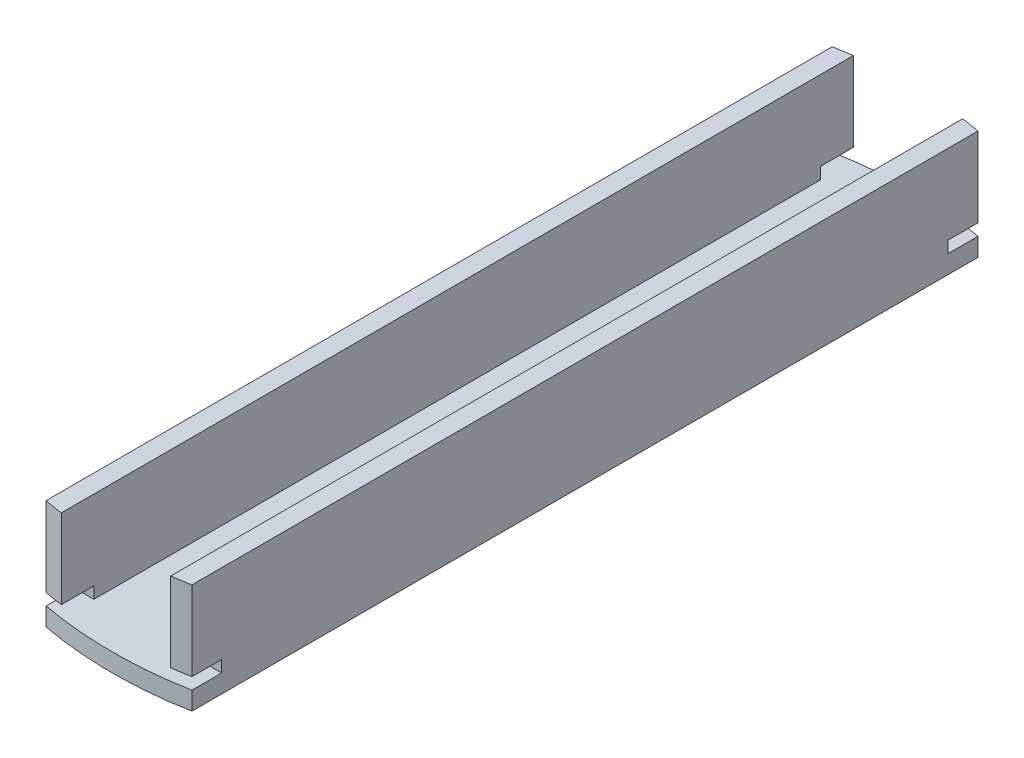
ISO-10303-21;
HEADER;
FILE_DESCRIPTION(('STEP AP214'),'2;1');
FILE_NAME('part.step','',(''),(''),'','','');
FILE_SCHEMA(('AUTOMOTIVE_DESIGN { 1 0 10303 214 1 1 1 1 }'));
ENDSEC;
DATA;
#1=APPLICATION_CONTEXT('core data for automotive mechanical design processes');
#2=APPLICATION_PROTOCOL_DEFINITION('international standard','automotive_design',2000,#1);
#3=PRODUCT_CONTEXT('',#1,'mechanical');
#4=PRODUCT('Part','Part','',(#3));
#5=PRODUCT_RELATED_PRODUCT_CATEGORY('part','',(#4));
#6=PRODUCT_DEFINITION_FORMATION('','',#4);
#7=PRODUCT_DEFINITION_CONTEXT('part definition',#1,'design');
#8=PRODUCT_DEFINITION('design','',#6,#7);
#9=PRODUCT_DEFINITION_SHAPE('','',#8);
#10=(LENGTH_UNIT() NAMED_UNIT(*) SI_UNIT(.MILLI.,.METRE.));
#11=(NAMED_UNIT(*) PLANE_ANGLE_UNIT() SI_UNIT($,.RADIAN.));
#12=(NAMED_UNIT(*) SI_UNIT($,.STERADIAN.) SOLID_ANGLE_UNIT());
#13=UNCERTAINTY_MEASURE_WITH_UNIT(LENGTH_MEASURE(1.E-05),#10,'distance_accuracy_value','');
#14=(GEOMETRIC_REPRESENTATION_CONTEXT(3) GLOBAL_UNCERTAINTY_ASSIGNED_CONTEXT((#13)) GLOBAL_UNIT_ASSIGNED_CONTEXT((#10,
#11,#12)) REPRESENTATION_CONTEXT('',''));
#15=CARTESIAN_POINT('',(0.,0.,0.));
#16=DIRECTION('',(0.,0.,1.));
#17=DIRECTION('',(1.,0.,0.));
#18=AXIS2_PLACEMENT_3D('',#15,#16,#17);
#19=CARTESIAN_POINT('',(12.7000000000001,19.05,69.596));
#20=DIRECTION('',(0.,-1.,0.));
#21=DIRECTION('',(0.,0.,-1.));
#22=AXIS2_PLACEMENT_3D('',#19,#20,#21);
#23=CYLINDRICAL_SURFACE('',#22,69.596);
#24=DIRECTION('',(0.,-1.,0.));
#25=VECTOR('',#24,1.);
#26=CARTESIAN_POINT('',(2.37657116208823E-13,19.05,1.16856971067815));
#27=LINE('',#26,#25);
#28=CARTESIAN_POINT('',(0.,3.175,1.1685697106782));
#29=VERTEX_POINT('',#28);
#30=CARTESIAN_POINT('',(2.37657116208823E-13,0.,1.16856971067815));
#31=VERTEX_POINT('',#30);
#32=EDGE_CURVE('E265',#29,#31,#27,.T.);
#33=ORIENTED_EDGE('',*,*,#32,.F.);
#34=CARTESIAN_POINT('',(12.7000000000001,3.175,69.596));
#35=DIRECTION('',(0.,-1.,0.));
#36=DIRECTION('',(0.,0.,-1.));
#37=AXIS2_PLACEMENT_3D('',#34,#35,#36);
#38=CIRCLE('',#37,69.596);
#39=CARTESIAN_POINT('',(25.4,3.175,1.16856971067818));
#40=VERTEX_POINT('',#39);
#41=EDGE_CURVE('E257',#29,#40,#38,.T.);
#42=ORIENTED_EDGE('',*,*,#41,.T.);
#43=DIRECTION('',(0.,-1.,0.));
#44=VECTOR('',#43,1.);
#45=CARTESIAN_POINT('',(25.4,19.05,1.16856971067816));
#46=LINE('',#45,#44);
#47=CARTESIAN_POINT('',(25.4,0.,1.16856971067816));
#48=VERTEX_POINT('',#47);
#49=EDGE_CURVE('E261',#40,#48,#46,.T.);
#50=ORIENTED_EDGE('',*,*,#49,.T.);
#51=CARTESIAN_POINT('',(12.7000000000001,0.,69.596));
#52=DIRECTION('',(0.,-1.,0.));
#53=DIRECTION('',(0.,0.,-1.));
#54=AXIS2_PLACEMENT_3D('',#51,#52,#53);
#55=CIRCLE('',#54,69.596);
#56=EDGE_CURVE('E244',#31,#48,#55,.T.);
#57=ORIENTED_EDGE('',*,*,#56,.F.);
#58=EDGE_LOOP('',(#33,#42,#50,#57));
#59=FACE_BOUND('',#58,.T.);
#60=ADVANCED_FACE('F28',(#59),#23,.T.);
#61=CARTESIAN_POINT('',(12.7000000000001,5.207,69.596));
#62=DIRECTION('',(0.,1.,0.));
#63=DIRECTION('',(0.,0.,1.));
#64=AXIS2_PLACEMENT_3D('',#61,#62,#63);
#65=CIRCLE('',#64,69.596);
#66=CARTESIAN_POINT('',(2.37657116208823E-13,5.20700000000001,1.16856971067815));
#67=VERTEX_POINT('',#66);
#68=CARTESIAN_POINT('',(3.175,5.207,0.654883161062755));
#69=VERTEX_POINT('',#68);
#70=EDGE_CURVE('E36',#67,#69,#65,.F.);
#71=ORIENTED_EDGE('',*,*,#70,.F.);
#72=CARTESIAN_POINT('',(2.37657116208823E-13,19.05,1.16856971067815));
#73=VERTEX_POINT('',#72);
#74=EDGE_CURVE('E262',#73,#67,#27,.T.);
#75=ORIENTED_EDGE('',*,*,#74,.F.);
#76=CARTESIAN_POINT('',(12.7000000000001,19.05,69.596));
#77=DIRECTION('',(0.,-1.,0.));
#78=DIRECTION('',(0.,0.,-1.));
#79=AXIS2_PLACEMENT_3D('',#76,#77,#78);
#80=CIRCLE('',#79,69.596);
#81=CARTESIAN_POINT('',(3.175,19.05,0.654883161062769));
#82=VERTEX_POINT('',#81);
#83=EDGE_CURVE('E251',#73,#82,#80,.T.);
#84=ORIENTED_EDGE('',*,*,#83,.T.);
#85=DIRECTION('',(0.,-1.,0.));
#86=VECTOR('',#85,1.);
#87=CARTESIAN_POINT('',(3.175,19.05,0.654883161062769));
#88=LINE('',#87,#86);
#89=EDGE_CURVE('E303',#82,#69,#88,.T.);
#90=ORIENTED_EDGE('',*,*,#89,.T.);
#91=EDGE_LOOP('',(#71,#75,#84,#90));
#92=FACE_BOUND('',#91,.T.);
#93=ADVANCED_FACE('F322',(#92),#23,.T.);
#94=CARTESIAN_POINT('',(12.7000000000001,19.05,69.596));
#95=DIRECTION('',(0.,-1.,0.));
#96=DIRECTION('',(0.,0.,-1.));
#97=AXIS2_PLACEMENT_3D('',#94,#95,#96);
#98=CYLINDRICAL_SURFACE('',#97,69.596);
#99=CARTESIAN_POINT('',(12.7000000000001,5.207,69.596));
#100=DIRECTION('',(0.,1.,0.));
#101=DIRECTION('',(0.,0.,1.));
#102=AXIS2_PLACEMENT_3D('',#99,#100,#101);
#103=CIRCLE('',#102,69.596);
#104=CARTESIAN_POINT('',(3.175,5.207,138.537116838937));
#105=VERTEX_POINT('',#104);
#106=CARTESIAN_POINT('',(0.,5.207,138.023430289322));
#107=VERTEX_POINT('',#106);
#108=EDGE_CURVE('E312',#105,#107,#103,.F.);
#109=ORIENTED_EDGE('',*,*,#108,.F.);
#110=DIRECTION('',(0.,-1.,0.));
#111=VECTOR('',#110,1.);
#112=CARTESIAN_POINT('',(3.175,19.05,138.537116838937));
#113=LINE('',#112,#111);
#114=CARTESIAN_POINT('',(3.175,19.05,138.537116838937));
#115=VERTEX_POINT('',#114);
#116=EDGE_CURVE('E308',#105,#115,#113,.F.);
#117=ORIENTED_EDGE('',*,*,#116,.T.);
#118=CARTESIAN_POINT('',(12.7000000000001,19.05,69.596));
#119=DIRECTION('',(0.,-1.,0.));
#120=DIRECTION('',(0.,0.,-1.));
#121=AXIS2_PLACEMENT_3D('',#118,#119,#120);
#122=CIRCLE('',#121,69.596);
#123=CARTESIAN_POINT('',(4.37150315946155E-13,19.05,138.023430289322));
#124=VERTEX_POINT('',#123);
#125=EDGE_CURVE('E247',#115,#124,#122,.T.);
#126=ORIENTED_EDGE('',*,*,#125,.T.);
#127=DIRECTION('',(0.,-1.,0.));
#128=VECTOR('',#127,1.);
#129=CARTESIAN_POINT('',(4.37150315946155E-13,19.05,138.023430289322));
#130=LINE('',#129,#128);
#131=EDGE_CURVE('E266',#124,#107,#130,.T.);
#132=ORIENTED_EDGE('',*,*,#131,.T.);
#133=EDGE_LOOP('',(#109,#117,#126,#132));
#134=FACE_BOUND('',#133,.T.);
#135=ADVANCED_FACE('F333',(#134),#98,.T.);
#136=CARTESIAN_POINT('',(25.4,5.207,138.023430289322));
#137=VERTEX_POINT('',#136);
#138=CARTESIAN_POINT('',(22.225,5.207,138.537116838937));
#139=VERTEX_POINT('',#138);
#140=EDGE_CURVE('E310',#137,#139,#103,.F.);
#141=ORIENTED_EDGE('',*,*,#140,.F.);
#142=DIRECTION('',(0.,-1.,0.));
#143=VECTOR('',#142,1.);
#144=CARTESIAN_POINT('',(25.4,19.05,138.023430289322));
#145=LINE('',#144,#143);
#146=CARTESIAN_POINT('',(25.4,19.05,138.023430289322));
#147=VERTEX_POINT('',#146);
#148=EDGE_CURVE('E254',#147,#137,#145,.T.);
#149=ORIENTED_EDGE('',*,*,#148,.F.);
#150=CARTESIAN_POINT('',(22.225,19.05,138.537116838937));
#151=VERTEX_POINT('',#150);
#152=EDGE_CURVE('E248',#147,#151,#122,.T.);
#153=ORIENTED_EDGE('',*,*,#152,.T.);
#154=DIRECTION('',(0.,-1.,0.));
#155=VECTOR('',#154,1.);
#156=CARTESIAN_POINT('',(22.225,19.05,138.537116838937));
#157=LINE('',#156,#155);
#158=EDGE_CURVE('E274',#151,#139,#157,.T.);
#159=ORIENTED_EDGE('',*,*,#158,.T.);
#160=EDGE_LOOP('',(#141,#149,#153,#159));
#161=FACE_BOUND('',#160,.T.);
#162=ADVANCED_FACE('F382',(#161),#98,.T.);
#163=CARTESIAN_POINT('',(0.,19.05,139.192));
#164=DIRECTION('',(0.,-1.,0.));
#165=DIRECTION('',(0.,0.,-1.));
#166=AXIS2_PLACEMENT_3D('',#163,#164,#165);
#167=PLANE('',#166);
#168=ORIENTED_EDGE('',*,*,#152,.F.);
#169=DIRECTION('',(0.,0.,-1.));
#170=VECTOR('',#169,1.);
#171=CARTESIAN_POINT('',(25.4,19.05,139.192));
#172=LINE('',#171,#170);
#173=CARTESIAN_POINT('',(25.4,19.05,1.16856971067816));
#174=VERTEX_POINT('',#173);
#175=EDGE_CURVE('E294',#147,#174,#172,.T.);
#176=ORIENTED_EDGE('',*,*,#175,.T.);
#177=CARTESIAN_POINT('',(22.225,19.05,0.654883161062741));
#178=VERTEX_POINT('',#177);
#179=EDGE_CURVE('E250',#178,#174,#80,.T.);
#180=ORIENTED_EDGE('',*,*,#179,.F.);
#181=DIRECTION('',(0.,0.,1.));
#182=VECTOR('',#181,1.);
#183=CARTESIAN_POINT('',(22.225,19.0499999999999,0.));
#184=LINE('',#183,#182);
#185=EDGE_CURVE('E281',#178,#151,#184,.T.);
#186=ORIENTED_EDGE('',*,*,#185,.T.);
#187=EDGE_LOOP('',(#168,#176,#180,#186));
#188=FACE_BOUND('',#187,.T.);
#189=ADVANCED_FACE('F378',(#188),#167,.F.);
#190=CARTESIAN_POINT('',(0.,0.,139.192));
#191=DIRECTION('',(1.,0.,0.));
#192=DIRECTION('',(0.,0.,-1.));
#193=AXIS2_PLACEMENT_3D('',#190,#191,#192);
#194=PLANE('',#193);
#195=DIRECTION('',(0.,-1.,0.));
#196=VECTOR('',#195,1.);
#197=CARTESIAN_POINT('',(0.,3.175,6.34999999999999));
#198=LINE('',#197,#196);
#199=CARTESIAN_POINT('',(0.,5.207,6.34999999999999));
#200=VERTEX_POINT('',#199);
#201=CARTESIAN_POINT('',(0.,3.175,6.34999999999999));
#202=VERTEX_POINT('',#201);
#203=EDGE_CURVE('E174',#200,#202,#198,.T.);
#204=ORIENTED_EDGE('',*,*,#203,.T.);
#205=DIRECTION('',(0.,0.,-1.));
#206=VECTOR('',#205,1.);
#207=CARTESIAN_POINT('',(0.,3.175,0.));
#208=LINE('',#207,#206);
#209=EDGE_CURVE('E188',#202,#29,#208,.T.);
#210=ORIENTED_EDGE('',*,*,#209,.T.);
#211=ORIENTED_EDGE('',*,*,#32,.T.);
#212=DIRECTION('',(0.,0.,-1.));
#213=VECTOR('',#212,1.);
#214=CARTESIAN_POINT('',(0.,0.,139.192));
#215=LINE('',#214,#213);
#216=CARTESIAN_POINT('',(4.37150315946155E-13,0.,138.023430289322));
#217=VERTEX_POINT('',#216);
#218=EDGE_CURVE('E300',#217,#31,#215,.T.);
#219=ORIENTED_EDGE('',*,*,#218,.F.);
#220=CARTESIAN_POINT('',(4.37150315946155E-13,3.17500000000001,138.023430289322));
#221=VERTEX_POINT('',#220);
#222=EDGE_CURVE('E253',#221,#217,#130,.T.);
#223=ORIENTED_EDGE('',*,*,#222,.F.);
#224=DIRECTION('',(0.,0.,-1.));
#225=VECTOR('',#224,1.);
#226=CARTESIAN_POINT('',(0.,3.175,139.192));
#227=LINE('',#226,#225);
#228=CARTESIAN_POINT('',(0.,3.175,132.842));
#229=VERTEX_POINT('',#228);
#230=EDGE_CURVE('E215',#221,#229,#227,.T.);
#231=ORIENTED_EDGE('',*,*,#230,.T.);
#232=DIRECTION('',(0.,1.,0.));
#233=VECTOR('',#232,1.);
#234=CARTESIAN_POINT('',(0.,3.175,132.842));
#235=LINE('',#234,#233);
#236=CARTESIAN_POINT('',(0.,5.207,132.842));
#237=VERTEX_POINT('',#236);
#238=EDGE_CURVE('E218',#229,#237,#235,.T.);
#239=ORIENTED_EDGE('',*,*,#238,.T.);
#240=DIRECTION('',(0.,0.,1.));
#241=VECTOR('',#240,1.);
#242=CARTESIAN_POINT('',(0.,5.207,139.192));
#243=LINE('',#242,#241);
#244=EDGE_CURVE('E221',#237,#107,#243,.T.);
#245=ORIENTED_EDGE('',*,*,#244,.T.);
#246=ORIENTED_EDGE('',*,*,#131,.F.);
#247=DIRECTION('',(0.,0.,-1.));
#248=VECTOR('',#247,1.);
#249=CARTESIAN_POINT('',(0.,19.05,139.192));
#250=LINE('',#249,#248);
#251=EDGE_CURVE('E284',#124,#73,#250,.T.);
#252=ORIENTED_EDGE('',*,*,#251,.T.);
#253=ORIENTED_EDGE('',*,*,#74,.T.);
#254=DIRECTION('',(0.,0.,1.));
#255=VECTOR('',#254,1.);
#256=CARTESIAN_POINT('',(0.,5.207,0.));
#257=LINE('',#256,#255);
#258=EDGE_CURVE('E43',#67,#200,#257,.T.);
#259=ORIENTED_EDGE('',*,*,#258,.T.);
#260=EDGE_LOOP('',(#204,#210,#211,#219,#223,#231,#239,#245,#246,#252,#253,#259));
#261=FACE_BOUND('',#260,.T.);
#262=ADVANCED_FACE('F30',(#261),#194,.F.);
#263=CARTESIAN_POINT('',(0.,0.,139.192));
#264=DIRECTION('',(0.,1.,0.));
#265=DIRECTION('',(0.,0.,1.));
#266=AXIS2_PLACEMENT_3D('',#263,#264,#265);
#267=PLANE('',#266);
#268=CARTESIAN_POINT('',(12.7000000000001,0.,69.596));
#269=DIRECTION('',(0.,-1.,0.));
#270=DIRECTION('',(0.,0.,-1.));
#271=AXIS2_PLACEMENT_3D('',#268,#269,#270);
#272=CIRCLE('',#271,3.2639);
#273=CARTESIAN_POINT('',(12.7000000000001,0.,66.3321));
#274=VERTEX_POINT('',#273);
#275=EDGE_CURVE('E277',#274,#274,#272,.T.);
#276=ORIENTED_EDGE('',*,*,#275,.F.);
#277=EDGE_LOOP('',(#276));
#278=FACE_BOUND('',#277,.T.);
#279=CARTESIAN_POINT('',(12.7000000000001,0.,69.596));
#280=DIRECTION('',(0.,-1.,0.));
#281=DIRECTION('',(0.,0.,-1.));
#282=AXIS2_PLACEMENT_3D('',#279,#280,#281);
#283=CIRCLE('',#282,69.596);
#284=CARTESIAN_POINT('',(25.4,0.,138.023430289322));
#285=VERTEX_POINT('',#284);
#286=EDGE_CURVE('E241',#285,#217,#283,.T.);
#287=ORIENTED_EDGE('',*,*,#286,.T.);
#288=ORIENTED_EDGE('',*,*,#218,.T.);
#289=ORIENTED_EDGE('',*,*,#56,.T.);
#290=DIRECTION('',(0.,0.,-1.));
#291=VECTOR('',#290,1.);
#292=CARTESIAN_POINT('',(25.4,0.,139.192));
#293=LINE('',#292,#291);
#294=EDGE_CURVE('E297',#285,#48,#293,.T.);
#295=ORIENTED_EDGE('',*,*,#294,.F.);
#296=EDGE_LOOP('',(#287,#288,#289,#295));
#297=FACE_BOUND('',#296,.T.);
#298=ADVANCED_FACE('F355',(#278,#297),#267,.F.);
#299=CARTESIAN_POINT('',(25.4,0.,139.192));
#300=DIRECTION('',(-1.,0.,0.));
#301=DIRECTION('',(0.,0.,1.));
#302=AXIS2_PLACEMENT_3D('',#299,#300,#301);
#303=PLANE('',#302);
#304=ORIENTED_EDGE('',*,*,#49,.F.);
#305=DIRECTION('',(0.,0.,-1.));
#306=VECTOR('',#305,1.);
#307=CARTESIAN_POINT('',(25.4,3.175,0.));
#308=LINE('',#307,#306);
#309=CARTESIAN_POINT('',(25.4,3.175,6.34999999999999));
#310=VERTEX_POINT('',#309);
#311=EDGE_CURVE('E183',#310,#40,#308,.T.);
#312=ORIENTED_EDGE('',*,*,#311,.F.);
#313=DIRECTION('',(0.,-1.,0.));
#314=VECTOR('',#313,1.);
#315=CARTESIAN_POINT('',(25.4,3.175,6.34999999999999));
#316=LINE('',#315,#314);
#317=CARTESIAN_POINT('',(25.4,5.207,6.34999999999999));
#318=VERTEX_POINT('',#317);
#319=EDGE_CURVE('E169',#318,#310,#316,.T.);
#320=ORIENTED_EDGE('',*,*,#319,.F.);
#321=DIRECTION('',(0.,0.,1.));
#322=VECTOR('',#321,1.);
#323=CARTESIAN_POINT('',(25.4,5.207,0.));
#324=LINE('',#323,#322);
#325=CARTESIAN_POINT('',(25.4,5.207,1.16856971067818));
#326=VERTEX_POINT('',#325);
#327=EDGE_CURVE('E177',#326,#318,#324,.T.);
#328=ORIENTED_EDGE('',*,*,#327,.F.);
#329=EDGE_CURVE('E259',#174,#326,#46,.T.);
#330=ORIENTED_EDGE('',*,*,#329,.F.);
#331=ORIENTED_EDGE('',*,*,#175,.F.);
#332=ORIENTED_EDGE('',*,*,#148,.T.);
#333=DIRECTION('',(0.,0.,1.));
#334=VECTOR('',#333,1.);
#335=CARTESIAN_POINT('',(25.4,5.207,139.192));
#336=LINE('',#335,#334);
#337=CARTESIAN_POINT('',(25.4,5.207,132.842));
#338=VERTEX_POINT('',#337);
#339=EDGE_CURVE('E213',#338,#137,#336,.T.);
#340=ORIENTED_EDGE('',*,*,#339,.F.);
#341=DIRECTION('',(0.,1.,0.));
#342=VECTOR('',#341,1.);
#343=CARTESIAN_POINT('',(25.4,3.175,132.842));
#344=LINE('',#343,#342);
#345=CARTESIAN_POINT('',(25.4,3.175,132.842));
#346=VERTEX_POINT('',#345);
#347=EDGE_CURVE('E210',#346,#338,#344,.T.);
#348=ORIENTED_EDGE('',*,*,#347,.F.);
#349=DIRECTION('',(0.,0.,-1.));
#350=VECTOR('',#349,1.);
#351=CARTESIAN_POINT('',(25.4,3.175,139.192));
#352=LINE('',#351,#350);
#353=CARTESIAN_POINT('',(25.4,3.175,138.023430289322));
#354=VERTEX_POINT('',#353);
#355=EDGE_CURVE('E207',#354,#346,#352,.T.);
#356=ORIENTED_EDGE('',*,*,#355,.F.);
#357=EDGE_CURVE('E258',#354,#285,#145,.T.);
#358=ORIENTED_EDGE('',*,*,#357,.T.);
#359=ORIENTED_EDGE('',*,*,#294,.T.);
#360=EDGE_LOOP('',(#304,#312,#320,#328,#330,#331,#332,#340,#348,#356,#358,#359));
#361=FACE_BOUND('',#360,.T.);
#362=ADVANCED_FACE('F186',(#361),#303,.F.);
#363=ORIENTED_EDGE('',*,*,#125,.F.);
#364=DIRECTION('',(0.,0.,1.));
#365=VECTOR('',#364,1.);
#366=CARTESIAN_POINT('',(3.175,19.05,0.));
#367=LINE('',#366,#365);
#368=EDGE_CURVE('E289',#82,#115,#367,.T.);
#369=ORIENTED_EDGE('',*,*,#368,.F.);
#370=ORIENTED_EDGE('',*,*,#83,.F.);
#371=ORIENTED_EDGE('',*,*,#251,.F.);
#372=EDGE_LOOP('',(#363,#369,#370,#371));
#373=FACE_BOUND('',#372,.T.);
#374=ADVANCED_FACE('F327',(#373),#167,.F.);
#375=CARTESIAN_POINT('',(22.225,3.175,0.));
#376=DIRECTION('',(1.,0.,0.));
#377=DIRECTION('',(0.,1.,0.));
#378=AXIS2_PLACEMENT_3D('',#375,#376,#377);
#379=PLANE('',#378);
#380=DIRECTION('',(0.,0.,1.));
#381=VECTOR('',#380,1.);
#382=CARTESIAN_POINT('',(22.225,5.207,0.));
#383=LINE('',#382,#381);
#384=CARTESIAN_POINT('',(22.225,5.207,0.654883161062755));
#385=VERTEX_POINT('',#384);
#386=CARTESIAN_POINT('',(22.225,5.207,6.34999999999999));
#387=VERTEX_POINT('',#386);
#388=EDGE_CURVE('E51',#385,#387,#383,.T.);
#389=ORIENTED_EDGE('',*,*,#388,.T.);
#390=DIRECTION('',(0.,-1.,0.));
#391=VECTOR('',#390,1.);
#392=CARTESIAN_POINT('',(22.225,3.175,6.34999999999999));
#393=LINE('',#392,#391);
#394=CARTESIAN_POINT('',(22.225,3.175,6.34999999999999));
#395=VERTEX_POINT('',#394);
#396=EDGE_CURVE('E172',#387,#395,#393,.T.);
#397=ORIENTED_EDGE('',*,*,#396,.T.);
#398=DIRECTION('',(0.,0.,1.));
#399=VECTOR('',#398,1.);
#400=CARTESIAN_POINT('',(22.225,3.175,0.));
#401=LINE('',#400,#399);
#402=CARTESIAN_POINT('',(22.225,3.175,132.842));
#403=VERTEX_POINT('',#402);
#404=EDGE_CURVE('E285',#395,#403,#401,.T.);
#405=ORIENTED_EDGE('',*,*,#404,.T.);
#406=DIRECTION('',(0.,1.,0.));
#407=VECTOR('',#406,1.);
#408=CARTESIAN_POINT('',(22.225,3.175,132.842));
#409=LINE('',#408,#407);
#410=CARTESIAN_POINT('',(22.225,5.207,132.842));
#411=VERTEX_POINT('',#410);
#412=EDGE_CURVE('E238',#403,#411,#409,.T.);
#413=ORIENTED_EDGE('',*,*,#412,.T.);
#414=DIRECTION('',(0.,0.,1.));
#415=VECTOR('',#414,1.);
#416=CARTESIAN_POINT('',(22.225,5.207,0.));
#417=LINE('',#416,#415);
#418=EDGE_CURVE('E228',#411,#139,#417,.T.);
#419=ORIENTED_EDGE('',*,*,#418,.T.);
#420=ORIENTED_EDGE('',*,*,#158,.F.);
#421=ORIENTED_EDGE('',*,*,#185,.F.);
#422=DIRECTION('',(0.,-1.,0.));
#423=VECTOR('',#422,1.);
#424=CARTESIAN_POINT('',(22.225,19.05,0.654883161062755));
#425=LINE('',#424,#423);
#426=EDGE_CURVE('E270',#385,#178,#425,.F.);
#427=ORIENTED_EDGE('',*,*,#426,.F.);
#428=EDGE_LOOP('',(#389,#397,#405,#413,#419,#420,#421,#427));
#429=FACE_BOUND('',#428,.T.);
#430=ADVANCED_FACE('F369',(#429),#379,.F.);
#431=CARTESIAN_POINT('',(3.175,3.175,0.));
#432=DIRECTION('',(0.,-1.,0.));
#433=DIRECTION('',(0.,0.,-1.));
#434=AXIS2_PLACEMENT_3D('',#431,#432,#433);
#435=PLANE('',#434);
#436=CARTESIAN_POINT('',(12.7000000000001,3.17500000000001,69.596));
#437=DIRECTION('',(0.,-1.,0.));
#438=DIRECTION('',(0.,0.,-1.));
#439=AXIS2_PLACEMENT_3D('',#436,#437,#438);
#440=CIRCLE('',#439,3.2639);
#441=CARTESIAN_POINT('',(12.7000000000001,3.17500000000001,66.3321));
#442=VERTEX_POINT('',#441);
#443=EDGE_CURVE('E280',#442,#442,#440,.T.);
#444=ORIENTED_EDGE('',*,*,#443,.T.);
#445=EDGE_LOOP('',(#444));
#446=FACE_BOUND('',#445,.T.);
#447=ORIENTED_EDGE('',*,*,#404,.F.);
#448=DIRECTION('',(1.,0.,0.));
#449=VECTOR('',#448,1.);
#450=CARTESIAN_POINT('',(0.,3.175,6.34999999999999));
#451=LINE('',#450,#449);
#452=EDGE_CURVE('E199',#395,#310,#451,.T.);
#453=ORIENTED_EDGE('',*,*,#452,.T.);
#454=ORIENTED_EDGE('',*,*,#311,.T.);
#455=ORIENTED_EDGE('',*,*,#41,.F.);
#456=ORIENTED_EDGE('',*,*,#209,.F.);
#457=CARTESIAN_POINT('',(3.175,3.175,6.34999999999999));
#458=VERTEX_POINT('',#457);
#459=EDGE_CURVE('E197',#202,#458,#451,.T.);
#460=ORIENTED_EDGE('',*,*,#459,.T.);
#461=DIRECTION('',(0.,0.,1.));
#462=VECTOR('',#461,1.);
#463=CARTESIAN_POINT('',(3.175,3.175,0.));
#464=LINE('',#463,#462);
#465=CARTESIAN_POINT('',(3.175,3.175,132.842));
#466=VERTEX_POINT('',#465);
#467=EDGE_CURVE('E287',#458,#466,#464,.T.);
#468=ORIENTED_EDGE('',*,*,#467,.T.);
#469=DIRECTION('',(1.,0.,0.));
#470=VECTOR('',#469,1.);
#471=CARTESIAN_POINT('',(0.,3.175,132.842));
#472=LINE('',#471,#470);
#473=EDGE_CURVE('E230',#229,#466,#472,.T.);
#474=ORIENTED_EDGE('',*,*,#473,.F.);
#475=ORIENTED_EDGE('',*,*,#230,.F.);
#476=CARTESIAN_POINT('',(12.7000000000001,3.175,69.596));
#477=DIRECTION('',(0.,-1.,0.));
#478=DIRECTION('',(0.,0.,-1.));
#479=AXIS2_PLACEMENT_3D('',#476,#477,#478);
#480=CIRCLE('',#479,69.596);
#481=EDGE_CURVE('E272',#354,#221,#480,.T.);
#482=ORIENTED_EDGE('',*,*,#481,.F.);
#483=ORIENTED_EDGE('',*,*,#355,.T.);
#484=EDGE_CURVE('E224',#403,#346,#472,.T.);
#485=ORIENTED_EDGE('',*,*,#484,.F.);
#486=EDGE_LOOP('',(#447,#453,#454,#455,#456,#460,#468,#474,#475,#482,#483,#485));
#487=FACE_BOUND('',#486,.T.);
#488=ADVANCED_FACE('F343',(#446,#487),#435,.F.);
#489=CARTESIAN_POINT('',(3.175,19.05,0.));
#490=DIRECTION('',(-1.,0.,0.));
#491=DIRECTION('',(0.,-1.,0.));
#492=AXIS2_PLACEMENT_3D('',#489,#490,#491);
#493=PLANE('',#492);
#494=ORIENTED_EDGE('',*,*,#467,.F.);
#495=DIRECTION('',(0.,1.,0.));
#496=VECTOR('',#495,1.);
#497=CARTESIAN_POINT('',(3.175,19.05,6.34999999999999));
#498=LINE('',#497,#496);
#499=CARTESIAN_POINT('',(3.175,5.207,6.34999999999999));
#500=VERTEX_POINT('',#499);
#501=EDGE_CURVE('E11',#458,#500,#498,.T.);
#502=ORIENTED_EDGE('',*,*,#501,.T.);
#503=DIRECTION('',(0.,0.,-1.));
#504=VECTOR('',#503,1.);
#505=CARTESIAN_POINT('',(3.175,5.207,0.));
#506=LINE('',#505,#504);
#507=EDGE_CURVE('E203',#500,#69,#506,.T.);
#508=ORIENTED_EDGE('',*,*,#507,.T.);
#509=ORIENTED_EDGE('',*,*,#89,.F.);
#510=ORIENTED_EDGE('',*,*,#368,.T.);
#511=ORIENTED_EDGE('',*,*,#116,.F.);
#512=DIRECTION('',(0.,0.,-1.));
#513=VECTOR('',#512,1.);
#514=CARTESIAN_POINT('',(3.175,5.207,0.));
#515=LINE('',#514,#513);
#516=CARTESIAN_POINT('',(3.175,5.207,132.842));
#517=VERTEX_POINT('',#516);
#518=EDGE_CURVE('E235',#105,#517,#515,.T.);
#519=ORIENTED_EDGE('',*,*,#518,.T.);
#520=DIRECTION('',(0.,-1.,0.));
#521=VECTOR('',#520,1.);
#522=CARTESIAN_POINT('',(3.175,19.05,132.842));
#523=LINE('',#522,#521);
#524=EDGE_CURVE('E313',#517,#466,#523,.T.);
#525=ORIENTED_EDGE('',*,*,#524,.T.);
#526=EDGE_LOOP('',(#494,#502,#508,#509,#510,#511,#519,#525));
#527=FACE_BOUND('',#526,.T.);
#528=ADVANCED_FACE('F320',(#527),#493,.F.);
#529=CARTESIAN_POINT('',(12.7000000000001,139.192,69.596));
#530=DIRECTION('',(0.,-1.,0.));
#531=DIRECTION('',(0.,0.,-1.));
#532=AXIS2_PLACEMENT_3D('',#529,#530,#531);
#533=CYLINDRICAL_SURFACE('',#532,3.2639);
#534=ORIENTED_EDGE('',*,*,#275,.T.);
#535=EDGE_LOOP('',(#534));
#536=FACE_BOUND('',#535,.T.);
#537=ORIENTED_EDGE('',*,*,#443,.F.);
#538=EDGE_LOOP('',(#537));
#539=FACE_BOUND('',#538,.T.);
#540=ADVANCED_FACE('F401',(#536,#539),#533,.F.);
#541=EDGE_CURVE('E179',#385,#326,#65,.F.);
#542=ORIENTED_EDGE('',*,*,#541,.F.);
#543=ORIENTED_EDGE('',*,*,#426,.T.);
#544=ORIENTED_EDGE('',*,*,#179,.T.);
#545=ORIENTED_EDGE('',*,*,#329,.T.);
#546=EDGE_LOOP('',(#542,#543,#544,#545));
#547=FACE_BOUND('',#546,.T.);
#548=ADVANCED_FACE('F375',(#547),#23,.T.);
#549=ORIENTED_EDGE('',*,*,#481,.T.);
#550=ORIENTED_EDGE('',*,*,#222,.T.);
#551=ORIENTED_EDGE('',*,*,#286,.F.);
#552=ORIENTED_EDGE('',*,*,#357,.F.);
#553=EDGE_LOOP('',(#549,#550,#551,#552));
#554=FACE_BOUND('',#553,.T.);
#555=ADVANCED_FACE('F358',(#554),#98,.T.);
#556=CARTESIAN_POINT('',(0.,5.207,139.192));
#557=DIRECTION('',(0.,1.,0.));
#558=DIRECTION('',(0.,0.,1.));
#559=AXIS2_PLACEMENT_3D('',#556,#557,#558);
#560=PLANE('',#559);
#561=DIRECTION('',(1.,0.,0.));
#562=VECTOR('',#561,1.);
#563=CARTESIAN_POINT('',(0.,5.207,132.842));
#564=LINE('',#563,#562);
#565=EDGE_CURVE('E229',#411,#338,#564,.T.);
#566=ORIENTED_EDGE('',*,*,#565,.T.);
#567=ORIENTED_EDGE('',*,*,#339,.T.);
#568=ORIENTED_EDGE('',*,*,#140,.T.);
#569=ORIENTED_EDGE('',*,*,#418,.F.);
#570=EDGE_LOOP('',(#566,#567,#568,#569));
#571=FACE_BOUND('',#570,.T.);
#572=ADVANCED_FACE('F384',(#571),#560,.F.);
#573=CARTESIAN_POINT('',(0.,3.175,132.842));
#574=DIRECTION('',(0.,0.,-1.));
#575=DIRECTION('',(-1.,0.,0.));
#576=AXIS2_PLACEMENT_3D('',#573,#574,#575);
#577=PLANE('',#576);
#578=ORIENTED_EDGE('',*,*,#484,.T.);
#579=ORIENTED_EDGE('',*,*,#347,.T.);
#580=ORIENTED_EDGE('',*,*,#565,.F.);
#581=ORIENTED_EDGE('',*,*,#412,.F.);
#582=EDGE_LOOP('',(#578,#579,#580,#581));
#583=FACE_BOUND('',#582,.T.);
#584=ADVANCED_FACE('F366',(#583),#577,.F.);
#585=EDGE_CURVE('E225',#237,#517,#564,.T.);
#586=ORIENTED_EDGE('',*,*,#585,.F.);
#587=ORIENTED_EDGE('',*,*,#238,.F.);
#588=ORIENTED_EDGE('',*,*,#473,.T.);
#589=ORIENTED_EDGE('',*,*,#524,.F.);
#590=EDGE_LOOP('',(#586,#587,#588,#589));
#591=FACE_BOUND('',#590,.T.);
#592=ADVANCED_FACE('F339',(#591),#577,.F.);
#593=ORIENTED_EDGE('',*,*,#108,.T.);
#594=ORIENTED_EDGE('',*,*,#244,.F.);
#595=ORIENTED_EDGE('',*,*,#585,.T.);
#596=ORIENTED_EDGE('',*,*,#518,.F.);
#597=EDGE_LOOP('',(#593,#594,#595,#596));
#598=FACE_BOUND('',#597,.T.);
#599=ADVANCED_FACE('F336',(#598),#560,.F.);
#600=CARTESIAN_POINT('',(0.,5.207,0.));
#601=DIRECTION('',(0.,1.,0.));
#602=DIRECTION('',(0.,0.,1.));
#603=AXIS2_PLACEMENT_3D('',#600,#601,#602);
#604=PLANE('',#603);
#605=ORIENTED_EDGE('',*,*,#541,.T.);
#606=ORIENTED_EDGE('',*,*,#327,.T.);
#607=DIRECTION('',(1.,0.,0.));
#608=VECTOR('',#607,1.);
#609=CARTESIAN_POINT('',(0.,5.207,6.34999999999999));
#610=LINE('',#609,#608);
#611=EDGE_CURVE('E165',#387,#318,#610,.T.);
#612=ORIENTED_EDGE('',*,*,#611,.F.);
#613=ORIENTED_EDGE('',*,*,#388,.F.);
#614=EDGE_LOOP('',(#605,#606,#612,#613));
#615=FACE_BOUND('',#614,.T.);
#616=ADVANCED_FACE('F178',(#615),#604,.F.);
#617=CARTESIAN_POINT('',(0.,3.175,6.34999999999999));
#618=DIRECTION('',(0.,0.,1.));
#619=DIRECTION('',(1.,0.,0.));
#620=AXIS2_PLACEMENT_3D('',#617,#618,#619);
#621=PLANE('',#620);
#622=ORIENTED_EDGE('',*,*,#611,.T.);
#623=ORIENTED_EDGE('',*,*,#319,.T.);
#624=ORIENTED_EDGE('',*,*,#452,.F.);
#625=ORIENTED_EDGE('',*,*,#396,.F.);
#626=EDGE_LOOP('',(#622,#623,#624,#625));
#627=FACE_BOUND('',#626,.T.);
#628=ADVANCED_FACE('F167',(#627),#621,.F.);
#629=ORIENTED_EDGE('',*,*,#459,.F.);
#630=ORIENTED_EDGE('',*,*,#203,.F.);
#631=EDGE_CURVE('E173',#200,#500,#610,.T.);
#632=ORIENTED_EDGE('',*,*,#631,.T.);
#633=ORIENTED_EDGE('',*,*,#501,.F.);
#634=EDGE_LOOP('',(#629,#630,#632,#633));
#635=FACE_BOUND('',#634,.T.);
#636=ADVANCED_FACE('F348',(#635),#621,.F.);
#637=ORIENTED_EDGE('',*,*,#631,.F.);
#638=ORIENTED_EDGE('',*,*,#258,.F.);
#639=ORIENTED_EDGE('',*,*,#70,.T.);
#640=ORIENTED_EDGE('',*,*,#507,.F.);
#641=EDGE_LOOP('',(#637,#638,#639,#640));
#642=FACE_BOUND('',#641,.T.);
#643=ADVANCED_FACE('F315',(#642),#604,.F.);
#644=CLOSED_SHELL('',(#60,#93,#135,#162,#189,#262,#298,#362,#374,#430,#488,#528,#540,#548,#555,
#572,#584,#592,#599,#616,#628,#636,#643));
#645=MANIFOLD_SOLID_BREP('B2',#644);
#646=ADVANCED_BREP_SHAPE_REPRESENTATION('',(#18,#645),#14);
#647=SHAPE_DEFINITION_REPRESENTATION(#9,#646);
ENDSEC;
END-ISO-10303-21;
